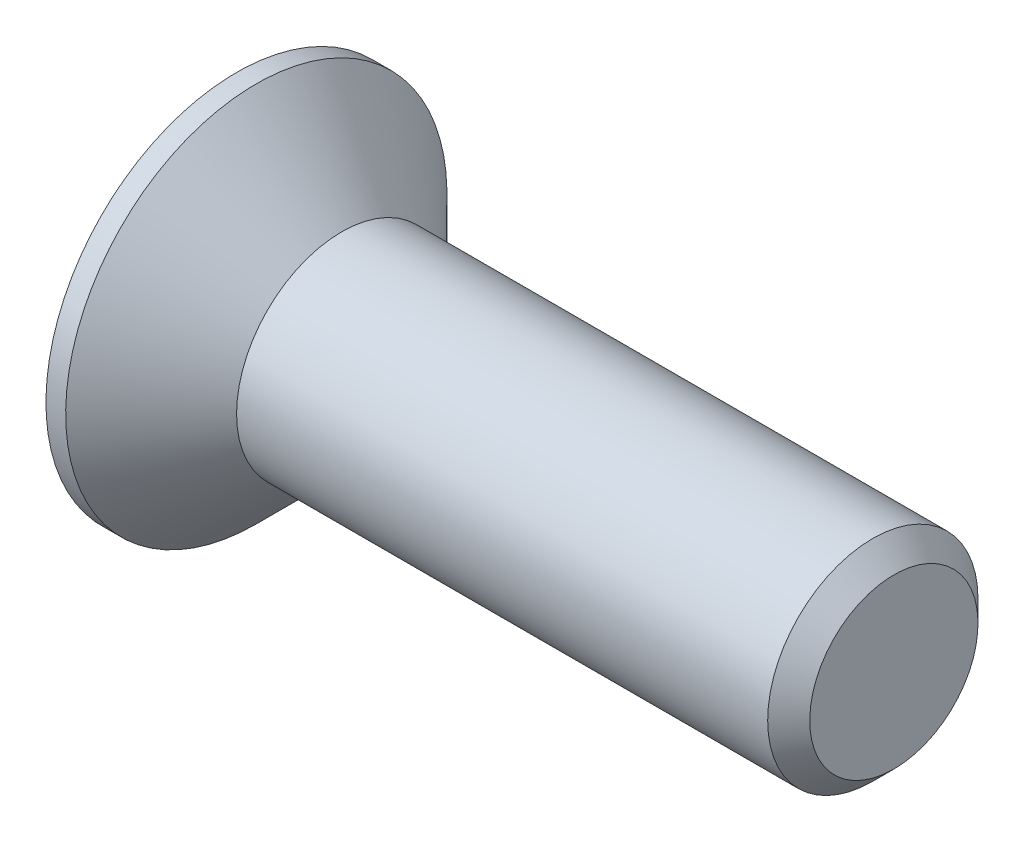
ISO-10303-21;
HEADER;
FILE_DESCRIPTION(('STEP AP214'),'2;1');
FILE_NAME('part.step','',(''),(''),'','','');
FILE_SCHEMA(('AUTOMOTIVE_DESIGN { 1 0 10303 214 1 1 1 1 }'));
ENDSEC;
DATA;
#1=APPLICATION_CONTEXT('core data for automotive mechanical design processes');
#2=APPLICATION_PROTOCOL_DEFINITION('international standard','automotive_design',2000,#1);
#3=PRODUCT_CONTEXT('',#1,'mechanical');
#4=PRODUCT('Part','Part','',(#3));
#5=PRODUCT_RELATED_PRODUCT_CATEGORY('part','',(#4));
#6=PRODUCT_DEFINITION_FORMATION('','',#4);
#7=PRODUCT_DEFINITION_CONTEXT('part definition',#1,'design');
#8=PRODUCT_DEFINITION('design','',#6,#7);
#9=PRODUCT_DEFINITION_SHAPE('','',#8);
#10=(LENGTH_UNIT() NAMED_UNIT(*) SI_UNIT(.MILLI.,.METRE.));
#11=(NAMED_UNIT(*) PLANE_ANGLE_UNIT() SI_UNIT($,.RADIAN.));
#12=(NAMED_UNIT(*) SI_UNIT($,.STERADIAN.) SOLID_ANGLE_UNIT());
#13=UNCERTAINTY_MEASURE_WITH_UNIT(LENGTH_MEASURE(1.E-05),#10,'distance_accuracy_value','');
#14=(GEOMETRIC_REPRESENTATION_CONTEXT(3) GLOBAL_UNCERTAINTY_ASSIGNED_CONTEXT((#13)) GLOBAL_UNIT_ASSIGNED_CONTEXT((#10,
#11,#12)) REPRESENTATION_CONTEXT('',''));
#15=CARTESIAN_POINT('',(0.,0.,0.));
#16=DIRECTION('',(0.,0.,1.));
#17=DIRECTION('',(1.,0.,0.));
#18=AXIS2_PLACEMENT_3D('',#15,#16,#17);
#19=CARTESIAN_POINT('',(0.,0.,0.));
#20=DIRECTION('',(-1.,0.,0.));
#21=DIRECTION('',(0.,-1.,0.));
#22=AXIS2_PLACEMENT_3D('',#19,#20,#21);
#23=CONICAL_SURFACE('',#22,4.,0.78539816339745);
#24=CARTESIAN_POINT('',(-3.24999999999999,0.,0.));
#25=DIRECTION('',(-1.,0.,0.));
#26=DIRECTION('',(0.,-1.,0.));
#27=AXIS2_PLACEMENT_3D('',#24,#25,#26);
#28=CIRCLE('',#27,7.25);
#29=CARTESIAN_POINT('',(-3.24999999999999,-7.25,0.));
#30=VERTEX_POINT('',#29);
#31=EDGE_CURVE('E189',#30,#30,#28,.T.);
#32=ORIENTED_EDGE('',*,*,#31,.F.);
#33=EDGE_LOOP('',(#32));
#34=FACE_BOUND('',#33,.T.);
#35=CARTESIAN_POINT('',(0.,0.,0.));
#36=DIRECTION('',(-1.,0.,0.));
#37=DIRECTION('',(0.,-1.,0.));
#38=AXIS2_PLACEMENT_3D('',#35,#36,#37);
#39=CIRCLE('',#38,4.);
#40=CARTESIAN_POINT('',(0.,-4.,0.));
#41=VERTEX_POINT('',#40);
#42=EDGE_CURVE('E212',#41,#41,#39,.T.);
#43=ORIENTED_EDGE('',*,*,#42,.T.);
#44=EDGE_LOOP('',(#43));
#45=FACE_BOUND('',#44,.T.);
#46=ADVANCED_FACE('F33',(#34,#45),#23,.T.);
#47=CARTESIAN_POINT('',(-4.,0.,0.));
#48=DIRECTION('',(-1.,0.,0.));
#49=DIRECTION('',(0.,-1.,0.));
#50=AXIS2_PLACEMENT_3D('',#47,#48,#49);
#51=CYLINDRICAL_SURFACE('',#50,4.);
#52=CARTESIAN_POINT('',(20.2,0.,0.));
#53=DIRECTION('',(-1.,0.,0.));
#54=DIRECTION('',(0.,-1.,0.));
#55=AXIS2_PLACEMENT_3D('',#52,#53,#54);
#56=CIRCLE('',#55,4.);
#57=CARTESIAN_POINT('',(20.2,-4.,0.));
#58=VERTEX_POINT('',#57);
#59=EDGE_CURVE('E41',#58,#58,#56,.T.);
#60=ORIENTED_EDGE('',*,*,#59,.T.);
#61=EDGE_LOOP('',(#60));
#62=FACE_BOUND('',#61,.T.);
#63=ORIENTED_EDGE('',*,*,#42,.F.);
#64=EDGE_LOOP('',(#63));
#65=FACE_BOUND('',#64,.T.);
#66=ADVANCED_FACE('F217',(#62,#65),#51,.T.);
#67=CARTESIAN_POINT('',(21.,0.,0.));
#68=DIRECTION('',(-1.,0.,0.));
#69=DIRECTION('',(0.,-1.,0.));
#70=AXIS2_PLACEMENT_3D('',#67,#68,#69);
#71=PLANE('',#70);
#72=CARTESIAN_POINT('',(21.,0.,0.));
#73=DIRECTION('',(-1.,0.,0.));
#74=DIRECTION('',(0.,-1.,0.));
#75=AXIS2_PLACEMENT_3D('',#72,#73,#74);
#76=CIRCLE('',#75,3.2);
#77=CARTESIAN_POINT('',(21.,-3.2,0.));
#78=VERTEX_POINT('',#77);
#79=EDGE_CURVE('E11',#78,#78,#76,.F.);
#80=ORIENTED_EDGE('',*,*,#79,.T.);
#81=EDGE_LOOP('',(#80));
#82=FACE_BOUND('',#81,.T.);
#83=ADVANCED_FACE('F239',(#82),#71,.F.);
#84=CARTESIAN_POINT('',(-4.,7.25,0.));
#85=DIRECTION('',(1.,0.,0.));
#86=DIRECTION('',(0.,1.,0.));
#87=AXIS2_PLACEMENT_3D('',#84,#85,#86);
#88=PLANE('',#87);
#89=DIRECTION('',(0.,0.,-1.));
#90=VECTOR('',#89,1.);
#91=CARTESIAN_POINT('',(-4.,1.09,-4.35));
#92=LINE('',#91,#90);
#93=CARTESIAN_POINT('',(-4.,1.09,-1.09));
#94=VERTEX_POINT('',#93);
#95=CARTESIAN_POINT('',(-4.,1.09,-4.35));
#96=VERTEX_POINT('',#95);
#97=EDGE_CURVE('E158',#94,#96,#92,.T.);
#98=ORIENTED_EDGE('',*,*,#97,.F.);
#99=DIRECTION('',(0.,-1.,0.));
#100=VECTOR('',#99,1.);
#101=CARTESIAN_POINT('',(-4.,1.09,-1.09));
#102=LINE('',#101,#100);
#103=CARTESIAN_POINT('',(-4.,4.35,-1.09));
#104=VERTEX_POINT('',#103);
#105=EDGE_CURVE('E48',#104,#94,#102,.T.);
#106=ORIENTED_EDGE('',*,*,#105,.F.);
#107=DIRECTION('',(0.,0.,-1.));
#108=VECTOR('',#107,1.);
#109=CARTESIAN_POINT('',(-4.,4.35,-1.09));
#110=LINE('',#109,#108);
#111=CARTESIAN_POINT('',(-4.,4.35,1.09));
#112=VERTEX_POINT('',#111);
#113=EDGE_CURVE('E185',#112,#104,#110,.T.);
#114=ORIENTED_EDGE('',*,*,#113,.F.);
#115=DIRECTION('',(0.,1.,0.));
#116=VECTOR('',#115,1.);
#117=CARTESIAN_POINT('',(-4.,4.35,1.09));
#118=LINE('',#117,#116);
#119=CARTESIAN_POINT('',(-4.,1.09,1.09));
#120=VERTEX_POINT('',#119);
#121=EDGE_CURVE('E183',#120,#112,#118,.T.);
#122=ORIENTED_EDGE('',*,*,#121,.F.);
#123=DIRECTION('',(0.,0.,-1.));
#124=VECTOR('',#123,1.);
#125=CARTESIAN_POINT('',(-4.,1.09,1.09));
#126=LINE('',#125,#124);
#127=CARTESIAN_POINT('',(-4.,1.09,4.35));
#128=VERTEX_POINT('',#127);
#129=EDGE_CURVE('E132',#128,#120,#126,.T.);
#130=ORIENTED_EDGE('',*,*,#129,.F.);
#131=DIRECTION('',(0.,1.,0.));
#132=VECTOR('',#131,1.);
#133=CARTESIAN_POINT('',(-4.,1.09,4.35));
#134=LINE('',#133,#132);
#135=CARTESIAN_POINT('',(-4.,-1.09,4.35));
#136=VERTEX_POINT('',#135);
#137=EDGE_CURVE('E179',#136,#128,#134,.T.);
#138=ORIENTED_EDGE('',*,*,#137,.F.);
#139=DIRECTION('',(0.,0.,1.));
#140=VECTOR('',#139,1.);
#141=CARTESIAN_POINT('',(-4.,-1.09,4.35));
#142=LINE('',#141,#140);
#143=CARTESIAN_POINT('',(-4.,-1.09,1.09));
#144=VERTEX_POINT('',#143);
#145=EDGE_CURVE('E176',#144,#136,#142,.T.);
#146=ORIENTED_EDGE('',*,*,#145,.F.);
#147=DIRECTION('',(0.,1.,0.));
#148=VECTOR('',#147,1.);
#149=CARTESIAN_POINT('',(-4.,-1.09,1.09));
#150=LINE('',#149,#148);
#151=CARTESIAN_POINT('',(-4.,-4.35,1.09));
#152=VERTEX_POINT('',#151);
#153=EDGE_CURVE('E173',#152,#144,#150,.T.);
#154=ORIENTED_EDGE('',*,*,#153,.F.);
#155=DIRECTION('',(0.,0.,1.));
#156=VECTOR('',#155,1.);
#157=CARTESIAN_POINT('',(-4.,-4.35,1.09));
#158=LINE('',#157,#156);
#159=CARTESIAN_POINT('',(-4.,-4.35,-1.09));
#160=VERTEX_POINT('',#159);
#161=EDGE_CURVE('E170',#160,#152,#158,.T.);
#162=ORIENTED_EDGE('',*,*,#161,.F.);
#163=DIRECTION('',(0.,-1.,0.));
#164=VECTOR('',#163,1.);
#165=CARTESIAN_POINT('',(-4.,-4.35,-1.09));
#166=LINE('',#165,#164);
#167=CARTESIAN_POINT('',(-4.,-1.09,-1.09));
#168=VERTEX_POINT('',#167);
#169=EDGE_CURVE('E167',#168,#160,#166,.T.);
#170=ORIENTED_EDGE('',*,*,#169,.F.);
#171=DIRECTION('',(0.,0.,1.));
#172=VECTOR('',#171,1.);
#173=CARTESIAN_POINT('',(-4.,-1.09,-1.09));
#174=LINE('',#173,#172);
#175=CARTESIAN_POINT('',(-4.,-1.09,-4.35));
#176=VERTEX_POINT('',#175);
#177=EDGE_CURVE('E164',#176,#168,#174,.T.);
#178=ORIENTED_EDGE('',*,*,#177,.F.);
#179=DIRECTION('',(0.,-1.,0.));
#180=VECTOR('',#179,1.);
#181=CARTESIAN_POINT('',(-4.,-1.09,-4.35));
#182=LINE('',#181,#180);
#183=EDGE_CURVE('E161',#96,#176,#182,.T.);
#184=ORIENTED_EDGE('',*,*,#183,.F.);
#185=EDGE_LOOP('',(#98,#106,#114,#122,#130,#138,#146,#154,#162,#170,#178,#184));
#186=FACE_BOUND('',#185,.T.);
#187=CARTESIAN_POINT('',(-4.,0.,0.));
#188=DIRECTION('',(-1.,0.,0.));
#189=DIRECTION('',(0.,-1.,0.));
#190=AXIS2_PLACEMENT_3D('',#187,#188,#189);
#191=CIRCLE('',#190,7.25);
#192=CARTESIAN_POINT('',(-4.,-7.25,0.));
#193=VERTEX_POINT('',#192);
#194=EDGE_CURVE('E209',#193,#193,#191,.T.);
#195=ORIENTED_EDGE('',*,*,#194,.T.);
#196=EDGE_LOOP('',(#195));
#197=FACE_BOUND('',#196,.T.);
#198=ADVANCED_FACE('F230',(#186,#197),#88,.F.);
#199=CARTESIAN_POINT('',(-4.,0.,0.));
#200=DIRECTION('',(-1.,0.,0.));
#201=DIRECTION('',(0.,-1.,0.));
#202=AXIS2_PLACEMENT_3D('',#199,#200,#201);
#203=CYLINDRICAL_SURFACE('',#202,7.25);
#204=ORIENTED_EDGE('',*,*,#194,.F.);
#205=EDGE_LOOP('',(#204));
#206=FACE_BOUND('',#205,.T.);
#207=ORIENTED_EDGE('',*,*,#31,.T.);
#208=EDGE_LOOP('',(#207));
#209=FACE_BOUND('',#208,.T.);
#210=ADVANCED_FACE('F222',(#206,#209),#203,.T.);
#211=CARTESIAN_POINT('',(20.2,0.,0.));
#212=DIRECTION('',(-1.,0.,0.));
#213=DIRECTION('',(0.,-1.,0.));
#214=AXIS2_PLACEMENT_3D('',#211,#212,#213);
#215=CONICAL_SURFACE('',#214,4.,0.785398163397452);
#216=ORIENTED_EDGE('',*,*,#79,.F.);
#217=EDGE_LOOP('',(#216));
#218=FACE_BOUND('',#217,.T.);
#219=ORIENTED_EDGE('',*,*,#59,.F.);
#220=EDGE_LOOP('',(#219));
#221=FACE_BOUND('',#220,.T.);
#222=ADVANCED_FACE('F35',(#218,#221),#215,.T.);
#223=CARTESIAN_POINT('',(-0.55,1.09,-1.09));
#224=DIRECTION('',(0.,0.,-1.));
#225=DIRECTION('',(-1.,0.,0.));
#226=AXIS2_PLACEMENT_3D('',#223,#224,#225);
#227=PLANE('',#226);
#228=ORIENTED_EDGE('',*,*,#105,.T.);
#229=DIRECTION('',(-1.,0.,0.));
#230=VECTOR('',#229,1.);
#231=CARTESIAN_POINT('',(-0.55,1.09,-1.09));
#232=LINE('',#231,#230);
#233=CARTESIAN_POINT('',(-0.55,1.09,-1.09));
#234=VERTEX_POINT('',#233);
#235=EDGE_CURVE('E96',#234,#94,#232,.T.);
#236=ORIENTED_EDGE('',*,*,#235,.F.);
#237=DIRECTION('',(0.,-1.,0.));
#238=VECTOR('',#237,1.);
#239=CARTESIAN_POINT('',(-0.55,1.09,-1.09));
#240=LINE('',#239,#238);
#241=CARTESIAN_POINT('',(-0.55,4.35,-1.09));
#242=VERTEX_POINT('',#241);
#243=EDGE_CURVE('E187',#242,#234,#240,.T.);
#244=ORIENTED_EDGE('',*,*,#243,.F.);
#245=DIRECTION('',(-1.,0.,0.));
#246=VECTOR('',#245,1.);
#247=CARTESIAN_POINT('',(-0.55,4.35,-1.09));
#248=LINE('',#247,#246);
#249=EDGE_CURVE('E56',#242,#104,#248,.T.);
#250=ORIENTED_EDGE('',*,*,#249,.T.);
#251=EDGE_LOOP('',(#228,#236,#244,#250));
#252=FACE_BOUND('',#251,.T.);
#253=ADVANCED_FACE('F221',(#252),#227,.F.);
#254=CARTESIAN_POINT('',(-0.55,4.35,-1.09));
#255=DIRECTION('',(0.,1.,0.));
#256=DIRECTION('',(-1.,0.,0.));
#257=AXIS2_PLACEMENT_3D('',#254,#255,#256);
#258=PLANE('',#257);
#259=ORIENTED_EDGE('',*,*,#113,.T.);
#260=ORIENTED_EDGE('',*,*,#249,.F.);
#261=DIRECTION('',(0.,0.,-1.));
#262=VECTOR('',#261,1.);
#263=CARTESIAN_POINT('',(-0.55,4.35,-1.09));
#264=LINE('',#263,#262);
#265=CARTESIAN_POINT('',(-0.55,4.35,1.09));
#266=VERTEX_POINT('',#265);
#267=EDGE_CURVE('E144',#266,#242,#264,.T.);
#268=ORIENTED_EDGE('',*,*,#267,.F.);
#269=DIRECTION('',(-1.,0.,0.));
#270=VECTOR('',#269,1.);
#271=CARTESIAN_POINT('',(-0.55,4.35,1.09));
#272=LINE('',#271,#270);
#273=EDGE_CURVE('E136',#266,#112,#272,.T.);
#274=ORIENTED_EDGE('',*,*,#273,.T.);
#275=EDGE_LOOP('',(#259,#260,#268,#274));
#276=FACE_BOUND('',#275,.T.);
#277=ADVANCED_FACE('F228',(#276),#258,.F.);
#278=CARTESIAN_POINT('',(-0.55,4.35,1.09));
#279=DIRECTION('',(0.,0.,1.));
#280=DIRECTION('',(1.,0.,0.));
#281=AXIS2_PLACEMENT_3D('',#278,#279,#280);
#282=PLANE('',#281);
#283=ORIENTED_EDGE('',*,*,#121,.T.);
#284=ORIENTED_EDGE('',*,*,#273,.F.);
#285=DIRECTION('',(0.,1.,0.));
#286=VECTOR('',#285,1.);
#287=CARTESIAN_POINT('',(-0.55,4.35,1.09));
#288=LINE('',#287,#286);
#289=CARTESIAN_POINT('',(-0.55,1.09,1.09));
#290=VERTEX_POINT('',#289);
#291=EDGE_CURVE('E140',#290,#266,#288,.T.);
#292=ORIENTED_EDGE('',*,*,#291,.F.);
#293=DIRECTION('',(-1.,0.,0.));
#294=VECTOR('',#293,1.);
#295=CARTESIAN_POINT('',(-0.55,1.09,1.09));
#296=LINE('',#295,#294);
#297=EDGE_CURVE('E125',#290,#120,#296,.T.);
#298=ORIENTED_EDGE('',*,*,#297,.T.);
#299=EDGE_LOOP('',(#283,#284,#292,#298));
#300=FACE_BOUND('',#299,.T.);
#301=ADVANCED_FACE('F141',(#300),#282,.F.);
#302=CARTESIAN_POINT('',(-0.55,1.09,1.09));
#303=DIRECTION('',(0.,1.,0.));
#304=DIRECTION('',(-1.,0.,0.));
#305=AXIS2_PLACEMENT_3D('',#302,#303,#304);
#306=PLANE('',#305);
#307=ORIENTED_EDGE('',*,*,#129,.T.);
#308=ORIENTED_EDGE('',*,*,#297,.F.);
#309=DIRECTION('',(0.,0.,-1.));
#310=VECTOR('',#309,1.);
#311=CARTESIAN_POINT('',(-0.55,1.09,1.09));
#312=LINE('',#311,#310);
#313=CARTESIAN_POINT('',(-0.55,1.09,4.35));
#314=VERTEX_POINT('',#313);
#315=EDGE_CURVE('E129',#314,#290,#312,.T.);
#316=ORIENTED_EDGE('',*,*,#315,.F.);
#317=DIRECTION('',(-1.,0.,0.));
#318=VECTOR('',#317,1.);
#319=CARTESIAN_POINT('',(-0.55,1.09,4.35));
#320=LINE('',#319,#318);
#321=EDGE_CURVE('E137',#314,#128,#320,.T.);
#322=ORIENTED_EDGE('',*,*,#321,.T.);
#323=EDGE_LOOP('',(#307,#308,#316,#322));
#324=FACE_BOUND('',#323,.T.);
#325=ADVANCED_FACE('F127',(#324),#306,.F.);
#326=CARTESIAN_POINT('',(-0.55,1.09,4.35));
#327=DIRECTION('',(0.,0.,1.));
#328=DIRECTION('',(1.,0.,0.));
#329=AXIS2_PLACEMENT_3D('',#326,#327,#328);
#330=PLANE('',#329);
#331=ORIENTED_EDGE('',*,*,#137,.T.);
#332=ORIENTED_EDGE('',*,*,#321,.F.);
#333=DIRECTION('',(0.,1.,0.));
#334=VECTOR('',#333,1.);
#335=CARTESIAN_POINT('',(-0.55,1.09,4.35));
#336=LINE('',#335,#334);
#337=CARTESIAN_POINT('',(-0.55,-1.09,4.35));
#338=VERTEX_POINT('',#337);
#339=EDGE_CURVE('E150',#338,#314,#336,.T.);
#340=ORIENTED_EDGE('',*,*,#339,.F.);
#341=DIRECTION('',(-1.,0.,0.));
#342=VECTOR('',#341,1.);
#343=CARTESIAN_POINT('',(-0.55,-1.09,4.35));
#344=LINE('',#343,#342);
#345=EDGE_CURVE('E192',#338,#136,#344,.T.);
#346=ORIENTED_EDGE('',*,*,#345,.T.);
#347=EDGE_LOOP('',(#331,#332,#340,#346));
#348=FACE_BOUND('',#347,.T.);
#349=ADVANCED_FACE('F277',(#348),#330,.F.);
#350=CARTESIAN_POINT('',(-0.55,-1.09,4.35));
#351=DIRECTION('',(0.,-1.,0.));
#352=DIRECTION('',(1.,0.,0.));
#353=AXIS2_PLACEMENT_3D('',#350,#351,#352);
#354=PLANE('',#353);
#355=ORIENTED_EDGE('',*,*,#145,.T.);
#356=ORIENTED_EDGE('',*,*,#345,.F.);
#357=DIRECTION('',(0.,0.,1.));
#358=VECTOR('',#357,1.);
#359=CARTESIAN_POINT('',(-0.55,-1.09,4.35));
#360=LINE('',#359,#358);
#361=CARTESIAN_POINT('',(-0.55,-1.09,1.09));
#362=VERTEX_POINT('',#361);
#363=EDGE_CURVE('E152',#362,#338,#360,.T.);
#364=ORIENTED_EDGE('',*,*,#363,.F.);
#365=DIRECTION('',(-1.,0.,0.));
#366=VECTOR('',#365,1.);
#367=CARTESIAN_POINT('',(-0.55,-1.09,1.09));
#368=LINE('',#367,#366);
#369=EDGE_CURVE('E194',#362,#144,#368,.T.);
#370=ORIENTED_EDGE('',*,*,#369,.T.);
#371=EDGE_LOOP('',(#355,#356,#364,#370));
#372=FACE_BOUND('',#371,.T.);
#373=ADVANCED_FACE('F273',(#372),#354,.F.);
#374=CARTESIAN_POINT('',(-0.55,-1.09,1.09));
#375=DIRECTION('',(0.,0.,1.));
#376=DIRECTION('',(1.,0.,0.));
#377=AXIS2_PLACEMENT_3D('',#374,#375,#376);
#378=PLANE('',#377);
#379=ORIENTED_EDGE('',*,*,#153,.T.);
#380=ORIENTED_EDGE('',*,*,#369,.F.);
#381=DIRECTION('',(0.,1.,0.));
#382=VECTOR('',#381,1.);
#383=CARTESIAN_POINT('',(-0.55,-1.09,1.09));
#384=LINE('',#383,#382);
#385=CARTESIAN_POINT('',(-0.55,-4.35,1.09));
#386=VERTEX_POINT('',#385);
#387=EDGE_CURVE('E422',#386,#362,#384,.T.);
#388=ORIENTED_EDGE('',*,*,#387,.F.);
#389=DIRECTION('',(-1.,0.,0.));
#390=VECTOR('',#389,1.);
#391=CARTESIAN_POINT('',(-0.55,-4.35,1.09));
#392=LINE('',#391,#390);
#393=EDGE_CURVE('E196',#386,#152,#392,.T.);
#394=ORIENTED_EDGE('',*,*,#393,.T.);
#395=EDGE_LOOP('',(#379,#380,#388,#394));
#396=FACE_BOUND('',#395,.T.);
#397=ADVANCED_FACE('F269',(#396),#378,.F.);
#398=CARTESIAN_POINT('',(-0.55,-4.35,1.09));
#399=DIRECTION('',(0.,-1.,0.));
#400=DIRECTION('',(1.,0.,0.));
#401=AXIS2_PLACEMENT_3D('',#398,#399,#400);
#402=PLANE('',#401);
#403=ORIENTED_EDGE('',*,*,#161,.T.);
#404=ORIENTED_EDGE('',*,*,#393,.F.);
#405=DIRECTION('',(0.,0.,1.));
#406=VECTOR('',#405,1.);
#407=CARTESIAN_POINT('',(-0.55,-4.35,1.09));
#408=LINE('',#407,#406);
#409=CARTESIAN_POINT('',(-0.55,-4.35,-1.09));
#410=VERTEX_POINT('',#409);
#411=EDGE_CURVE('E419',#410,#386,#408,.T.);
#412=ORIENTED_EDGE('',*,*,#411,.F.);
#413=DIRECTION('',(-1.,0.,0.));
#414=VECTOR('',#413,1.);
#415=CARTESIAN_POINT('',(-0.55,-4.35,-1.09));
#416=LINE('',#415,#414);
#417=EDGE_CURVE('E198',#410,#160,#416,.T.);
#418=ORIENTED_EDGE('',*,*,#417,.T.);
#419=EDGE_LOOP('',(#403,#404,#412,#418));
#420=FACE_BOUND('',#419,.T.);
#421=ADVANCED_FACE('F265',(#420),#402,.F.);
#422=CARTESIAN_POINT('',(-0.55,-4.35,-1.09));
#423=DIRECTION('',(0.,0.,-1.));
#424=DIRECTION('',(-1.,0.,0.));
#425=AXIS2_PLACEMENT_3D('',#422,#423,#424);
#426=PLANE('',#425);
#427=ORIENTED_EDGE('',*,*,#169,.T.);
#428=ORIENTED_EDGE('',*,*,#417,.F.);
#429=DIRECTION('',(0.,-1.,0.));
#430=VECTOR('',#429,1.);
#431=CARTESIAN_POINT('',(-0.55,-4.35,-1.09));
#432=LINE('',#431,#430);
#433=CARTESIAN_POINT('',(-0.55,-1.09,-1.09));
#434=VERTEX_POINT('',#433);
#435=EDGE_CURVE('E416',#434,#410,#432,.T.);
#436=ORIENTED_EDGE('',*,*,#435,.F.);
#437=DIRECTION('',(-1.,0.,0.));
#438=VECTOR('',#437,1.);
#439=CARTESIAN_POINT('',(-0.55,-1.09,-1.09));
#440=LINE('',#439,#438);
#441=EDGE_CURVE('E200',#434,#168,#440,.T.);
#442=ORIENTED_EDGE('',*,*,#441,.T.);
#443=EDGE_LOOP('',(#427,#428,#436,#442));
#444=FACE_BOUND('',#443,.T.);
#445=ADVANCED_FACE('F261',(#444),#426,.F.);
#446=CARTESIAN_POINT('',(-0.55,-1.09,-1.09));
#447=DIRECTION('',(0.,-1.,0.));
#448=DIRECTION('',(1.,0.,0.));
#449=AXIS2_PLACEMENT_3D('',#446,#447,#448);
#450=PLANE('',#449);
#451=ORIENTED_EDGE('',*,*,#177,.T.);
#452=ORIENTED_EDGE('',*,*,#441,.F.);
#453=DIRECTION('',(0.,0.,1.));
#454=VECTOR('',#453,1.);
#455=CARTESIAN_POINT('',(-0.55,-1.09,-1.09));
#456=LINE('',#455,#454);
#457=CARTESIAN_POINT('',(-0.55,-1.09,-4.35));
#458=VERTEX_POINT('',#457);
#459=EDGE_CURVE('E413',#458,#434,#456,.T.);
#460=ORIENTED_EDGE('',*,*,#459,.F.);
#461=DIRECTION('',(-1.,0.,0.));
#462=VECTOR('',#461,1.);
#463=CARTESIAN_POINT('',(-0.55,-1.09,-4.35));
#464=LINE('',#463,#462);
#465=EDGE_CURVE('E202',#458,#176,#464,.T.);
#466=ORIENTED_EDGE('',*,*,#465,.T.);
#467=EDGE_LOOP('',(#451,#452,#460,#466));
#468=FACE_BOUND('',#467,.T.);
#469=ADVANCED_FACE('F257',(#468),#450,.F.);
#470=CARTESIAN_POINT('',(-0.55,-1.09,-4.35));
#471=DIRECTION('',(0.,0.,-1.));
#472=DIRECTION('',(-1.,0.,0.));
#473=AXIS2_PLACEMENT_3D('',#470,#471,#472);
#474=PLANE('',#473);
#475=ORIENTED_EDGE('',*,*,#183,.T.);
#476=ORIENTED_EDGE('',*,*,#465,.F.);
#477=DIRECTION('',(0.,-1.,0.));
#478=VECTOR('',#477,1.);
#479=CARTESIAN_POINT('',(-0.55,-1.09,-4.35));
#480=LINE('',#479,#478);
#481=CARTESIAN_POINT('',(-0.55,1.09,-4.35));
#482=VERTEX_POINT('',#481);
#483=EDGE_CURVE('E408',#482,#458,#480,.T.);
#484=ORIENTED_EDGE('',*,*,#483,.F.);
#485=DIRECTION('',(-1.,0.,0.));
#486=VECTOR('',#485,1.);
#487=CARTESIAN_POINT('',(-0.55,1.09,-4.35));
#488=LINE('',#487,#486);
#489=EDGE_CURVE('E204',#482,#96,#488,.T.);
#490=ORIENTED_EDGE('',*,*,#489,.T.);
#491=EDGE_LOOP('',(#475,#476,#484,#490));
#492=FACE_BOUND('',#491,.T.);
#493=ADVANCED_FACE('F253',(#492),#474,.F.);
#494=CARTESIAN_POINT('',(-0.55,1.09,-4.35));
#495=DIRECTION('',(0.,1.,0.));
#496=DIRECTION('',(-1.,0.,0.));
#497=AXIS2_PLACEMENT_3D('',#494,#495,#496);
#498=PLANE('',#497);
#499=ORIENTED_EDGE('',*,*,#97,.T.);
#500=ORIENTED_EDGE('',*,*,#489,.F.);
#501=DIRECTION('',(0.,0.,-1.));
#502=VECTOR('',#501,1.);
#503=CARTESIAN_POINT('',(-0.55,1.09,-4.35));
#504=LINE('',#503,#502);
#505=EDGE_CURVE('E406',#234,#482,#504,.T.);
#506=ORIENTED_EDGE('',*,*,#505,.F.);
#507=ORIENTED_EDGE('',*,*,#235,.T.);
#508=EDGE_LOOP('',(#499,#500,#506,#507));
#509=FACE_BOUND('',#508,.T.);
#510=ADVANCED_FACE('F250',(#509),#498,.F.);
#511=CARTESIAN_POINT('',(-0.55,0.,0.));
#512=DIRECTION('',(1.,0.,0.));
#513=DIRECTION('',(0.,0.,-1.));
#514=AXIS2_PLACEMENT_3D('',#511,#512,#513);
#515=PLANE('',#514);
#516=ORIENTED_EDGE('',*,*,#243,.T.);
#517=ORIENTED_EDGE('',*,*,#505,.T.);
#518=ORIENTED_EDGE('',*,*,#483,.T.);
#519=ORIENTED_EDGE('',*,*,#459,.T.);
#520=ORIENTED_EDGE('',*,*,#435,.T.);
#521=ORIENTED_EDGE('',*,*,#411,.T.);
#522=ORIENTED_EDGE('',*,*,#387,.T.);
#523=ORIENTED_EDGE('',*,*,#363,.T.);
#524=ORIENTED_EDGE('',*,*,#339,.T.);
#525=ORIENTED_EDGE('',*,*,#315,.T.);
#526=ORIENTED_EDGE('',*,*,#291,.T.);
#527=ORIENTED_EDGE('',*,*,#267,.T.);
#528=EDGE_LOOP('',(#516,#517,#518,#519,#520,#521,#522,#523,#524,#525,#526,#527));
#529=FACE_BOUND('',#528,.T.);
#530=ADVANCED_FACE('F147',(#529),#515,.F.);
#531=CLOSED_SHELL('',(#46,#66,#83,#198,#210,#222,#253,#277,#301,#325,#349,#373,#397,#421,#445,
#469,#493,#510,#530));
#532=MANIFOLD_SOLID_BREP('B2',#531);
#533=ADVANCED_BREP_SHAPE_REPRESENTATION('',(#18,#532),#14);
#534=SHAPE_DEFINITION_REPRESENTATION(#9,#533);
ENDSEC;
END-ISO-10303-21;
